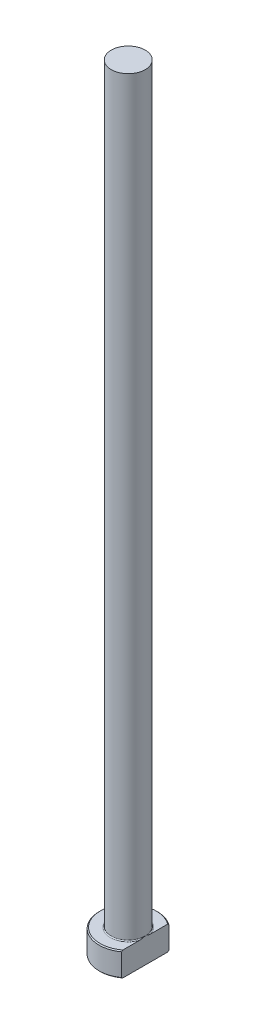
from build123d import *
from build123d.topology import SkipClean

# Parameters (mm, degrees)
CHAMFER1_SIZE = 0.2
FILLET1_R     = 0.2
KEY_DEPTH     = 161.224842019


with BuildPart() as part:
    # Sketch1 → Revolve1 (revolve)
    with BuildSketch(Plane.XY, mode=Mode.PRIVATE) as revolve1_sk:
        Polygon((0, 0), (-6, 0), (-6, 5), (-3.5, 5), (-3.5, 160), (0, 160), align=None)
    revolve(revolve1_sk.sketch.rotate(Axis((0, 259.958771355, 0), (0, -1, 0)), 270), axis=Axis((0, 259.958771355, 0), (0, -1, 0)))

    # Chamfer1
    chamfer1_edges = [part.edges().sort_by_distance(p)[0] for p in [
        (0, 5, -6),
        (0, 0, -6),
    ]]
    chamfer(chamfer1_edges, length=CHAMFER1_SIZE)

    # Fillet1
    fillet1_edges = [part.edges().sort_by_distance(p)[0] for p in [
        (0, 5, -3.5),
    ]]
    fillet(fillet1_edges, radius=FILLET1_R)

    # Sketch2 → KEY (cut, through all)
    with SkipClean():  # the faces are left unmerged after this step: merging them gives an invalid solid
        with BuildSketch(Plane(origin=(0, 0, 0), x_dir=(1, 0, 0), z_dir=(0, 1, 0))):
            with BuildLine():
                Line((3.5, 4.873397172), (3.5, -4.873397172))
                ThreePointArc((3.5, -4.873397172), (6, 0), (3.5, 4.873397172))
            make_face()
        extrude(amount=KEY_DEPTH, mode=Mode.SUBTRACT)


solid = part.part
